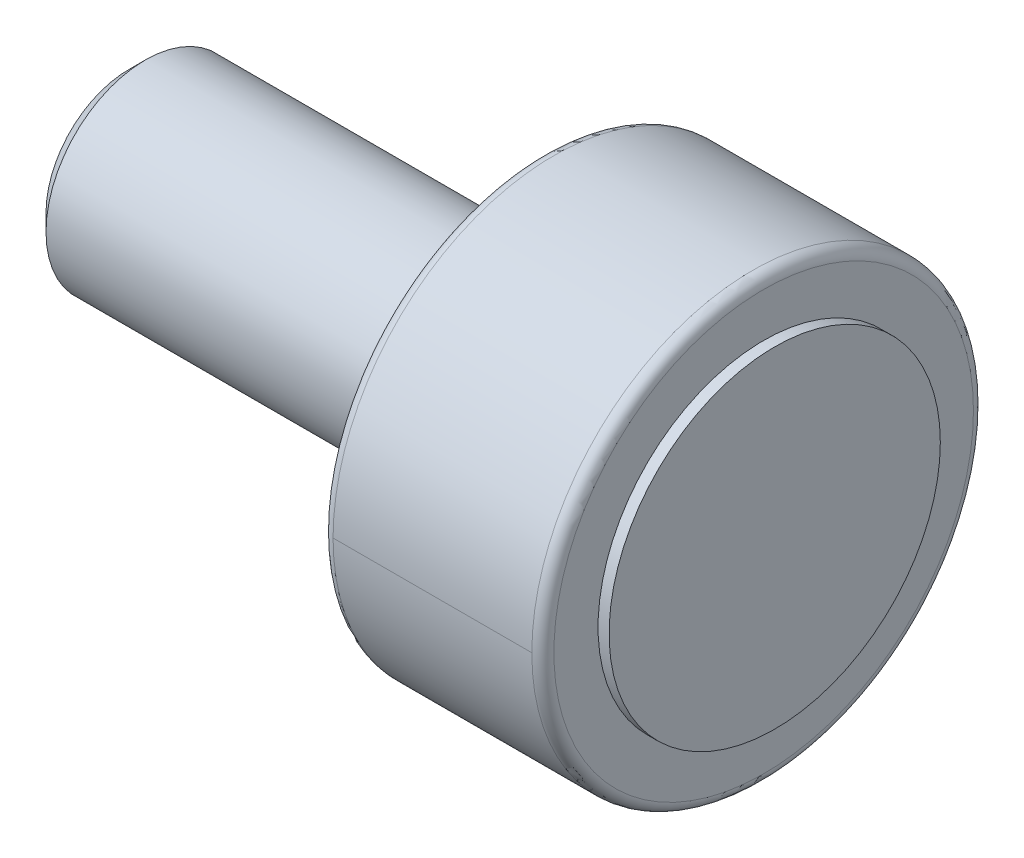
from build123d import *

# Parameters (mm, degrees)
CONG_1_R        = 1
CHANFREIN1_SIZE = 1.5


with BuildPart() as part:
    # Esquisse1 → R_volution1 (revolve)
    with BuildSketch(Plane.XY, mode=Mode.PRIVATE) as r_volution1_sk:
        Polygon((-58.5, 0), (-58.5, 9), (-22, 9), (-22, 15), (-21, 15), (-21, 20), (-1, 20), (-1, 15), (0, 15), (0, 0), align=None)
    revolve(r_volution1_sk.sketch.rotate(Axis((0, 0, 0), (-1, 0, 0)), 90), axis=Axis((0, 0, 0), (-1, 0, 0)))

    # Cong_1
    cong_1_edges = [part.edges().sort_by_distance(p)[0] for p in [
        (-21, 0, 20),
        (-1, 0, 20),
    ]]
    fillet(cong_1_edges, radius=CONG_1_R)

    # Chanfrein1
    chanfrein1_edges = [part.edges().sort_by_distance(p)[0] for p in [
        (-58.5, 0, 9),
    ]]
    chamfer(chanfrein1_edges, length=CHANFREIN1_SIZE)


solid = part.part
